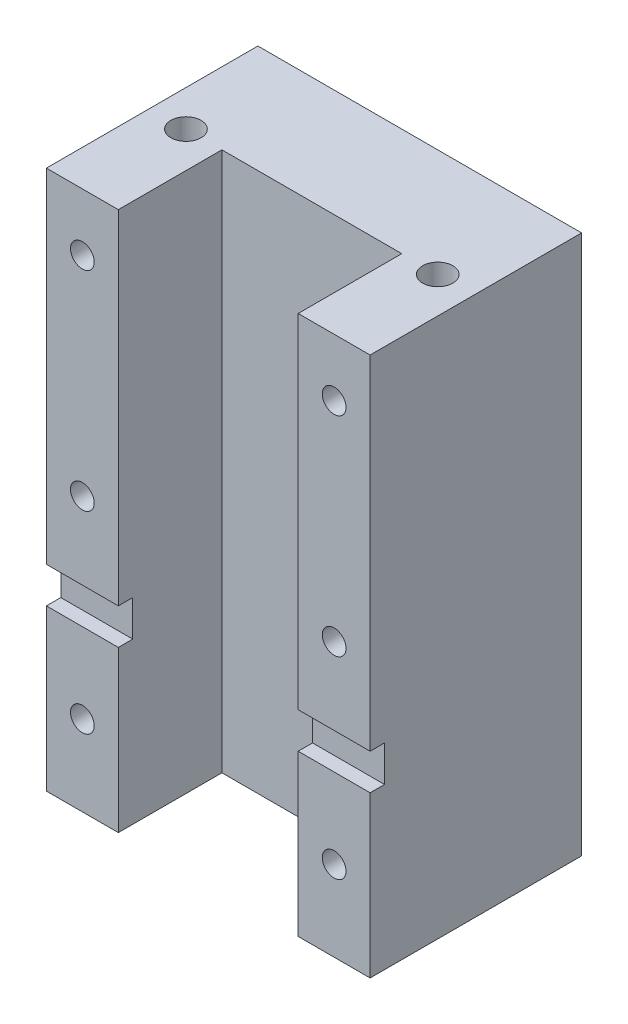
ISO-10303-21;
HEADER;
FILE_DESCRIPTION(('STEP AP214'),'2;1');
FILE_NAME('part.step','',(''),(''),'','','');
FILE_SCHEMA(('AUTOMOTIVE_DESIGN { 1 0 10303 214 1 1 1 1 }'));
ENDSEC;
DATA;
#1=APPLICATION_CONTEXT('core data for automotive mechanical design processes');
#2=APPLICATION_PROTOCOL_DEFINITION('international standard','automotive_design',2000,#1);
#3=PRODUCT_CONTEXT('',#1,'mechanical');
#4=PRODUCT('Part','Part','',(#3));
#5=PRODUCT_RELATED_PRODUCT_CATEGORY('part','',(#4));
#6=PRODUCT_DEFINITION_FORMATION('','',#4);
#7=PRODUCT_DEFINITION_CONTEXT('part definition',#1,'design');
#8=PRODUCT_DEFINITION('design','',#6,#7);
#9=PRODUCT_DEFINITION_SHAPE('','',#8);
#10=(LENGTH_UNIT() NAMED_UNIT(*) SI_UNIT(.MILLI.,.METRE.));
#11=(NAMED_UNIT(*) PLANE_ANGLE_UNIT() SI_UNIT($,.RADIAN.));
#12=(NAMED_UNIT(*) SI_UNIT($,.STERADIAN.) SOLID_ANGLE_UNIT());
#13=UNCERTAINTY_MEASURE_WITH_UNIT(LENGTH_MEASURE(1.E-05),#10,'distance_accuracy_value','');
#14=(GEOMETRIC_REPRESENTATION_CONTEXT(3) GLOBAL_UNCERTAINTY_ASSIGNED_CONTEXT((#13)) GLOBAL_UNIT_ASSIGNED_CONTEXT((#10,
#11,#12)) REPRESENTATION_CONTEXT('',''));
#15=CARTESIAN_POINT('',(0.,0.,0.));
#16=DIRECTION('',(0.,0.,1.));
#17=DIRECTION('',(1.,0.,0.));
#18=AXIS2_PLACEMENT_3D('',#15,#16,#17);
#19=CARTESIAN_POINT('',(45.,1.13686837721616E-13,29.4));
#20=DIRECTION('',(0.,0.,1.));
#21=DIRECTION('',(1.,0.,0.));
#22=AXIS2_PLACEMENT_3D('',#19,#20,#21);
#23=PLANE('',#22);
#24=CARTESIAN_POINT('',(5.,38.,29.4));
#25=DIRECTION('',(0.,0.,1.));
#26=DIRECTION('',(1.,0.,0.));
#27=AXIS2_PLACEMENT_3D('',#24,#25,#26);
#28=CIRCLE('',#27,1.65);
#29=CARTESIAN_POINT('',(6.65,38.,29.4));
#30=VERTEX_POINT('',#29);
#31=EDGE_CURVE('E341',#30,#30,#28,.T.);
#32=ORIENTED_EDGE('',*,*,#31,.F.);
#33=EDGE_LOOP('',(#32));
#34=FACE_BOUND('',#33,.T.);
#35=CARTESIAN_POINT('',(4.99999999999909,67.0000000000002,29.4));
#36=DIRECTION('',(0.,0.,1.));
#37=DIRECTION('',(1.,0.,0.));
#38=AXIS2_PLACEMENT_3D('',#35,#36,#37);
#39=CIRCLE('',#38,1.65);
#40=CARTESIAN_POINT('',(6.64999999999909,67.0000000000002,29.4));
#41=VERTEX_POINT('',#40);
#42=EDGE_CURVE('E323',#41,#41,#39,.T.);
#43=ORIENTED_EDGE('',*,*,#42,.F.);
#44=EDGE_LOOP('',(#43));
#45=FACE_BOUND('',#44,.T.);
#46=DIRECTION('',(1.,0.,0.));
#47=VECTOR('',#46,1.);
#48=CARTESIAN_POINT('',(45.,27.3000003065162,29.4));
#49=LINE('',#48,#47);
#50=CARTESIAN_POINT('',(0.,27.3000003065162,29.3999999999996));
#51=VERTEX_POINT('',#50);
#52=CARTESIAN_POINT('',(10.,27.3000003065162,29.4000000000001));
#53=VERTEX_POINT('',#52);
#54=EDGE_CURVE('E205',#51,#53,#49,.T.);
#55=ORIENTED_EDGE('',*,*,#54,.T.);
#56=DIRECTION('',(0.,-1.,0.));
#57=VECTOR('',#56,1.);
#58=CARTESIAN_POINT('',(10.,249.966611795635,29.4000000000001));
#59=LINE('',#58,#57);
#60=CARTESIAN_POINT('',(10.,75.0000000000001,29.4000000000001));
#61=VERTEX_POINT('',#60);
#62=EDGE_CURVE('E278',#61,#53,#59,.T.);
#63=ORIENTED_EDGE('',*,*,#62,.F.);
#64=DIRECTION('',(-1.,0.,0.));
#65=VECTOR('',#64,1.);
#66=CARTESIAN_POINT('',(0.,75.0000000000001,29.4));
#67=LINE('',#66,#65);
#68=CARTESIAN_POINT('',(0.,75.0000000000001,29.4));
#69=VERTEX_POINT('',#68);
#70=EDGE_CURVE('E170',#61,#69,#67,.T.);
#71=ORIENTED_EDGE('',*,*,#70,.T.);
#72=DIRECTION('',(0.,-1.,0.));
#73=VECTOR('',#72,1.);
#74=CARTESIAN_POINT('',(0.,1.13686837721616E-13,29.4));
#75=LINE('',#74,#73);
#76=EDGE_CURVE('E172',#69,#51,#75,.T.);
#77=ORIENTED_EDGE('',*,*,#76,.T.);
#78=EDGE_LOOP('',(#55,#63,#71,#77));
#79=FACE_BOUND('',#78,.T.);
#80=ADVANCED_FACE('F32',(#34,#45,#79),#23,.T.);
#81=CARTESIAN_POINT('',(40.,38.,29.4));
#82=DIRECTION('',(0.,0.,1.));
#83=DIRECTION('',(1.,0.,0.));
#84=AXIS2_PLACEMENT_3D('',#81,#82,#83);
#85=CIRCLE('',#84,1.65);
#86=CARTESIAN_POINT('',(41.65,38.,29.4));
#87=VERTEX_POINT('',#86);
#88=EDGE_CURVE('E335',#87,#87,#85,.T.);
#89=ORIENTED_EDGE('',*,*,#88,.F.);
#90=EDGE_LOOP('',(#89));
#91=FACE_BOUND('',#90,.T.);
#92=CARTESIAN_POINT('',(39.9999999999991,67.,29.4));
#93=DIRECTION('',(0.,0.,1.));
#94=DIRECTION('',(1.,0.,0.));
#95=AXIS2_PLACEMENT_3D('',#92,#93,#94);
#96=CIRCLE('',#95,1.65);
#97=CARTESIAN_POINT('',(41.6499999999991,67.,29.4));
#98=VERTEX_POINT('',#97);
#99=EDGE_CURVE('E329',#98,#98,#96,.T.);
#100=ORIENTED_EDGE('',*,*,#99,.F.);
#101=EDGE_LOOP('',(#100));
#102=FACE_BOUND('',#101,.T.);
#103=CARTESIAN_POINT('',(45.,75.0000000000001,29.4));
#104=VERTEX_POINT('',#103);
#105=CARTESIAN_POINT('',(35.,75.0000000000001,29.4000000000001));
#106=VERTEX_POINT('',#105);
#107=EDGE_CURVE('E162',#104,#106,#67,.T.);
#108=ORIENTED_EDGE('',*,*,#107,.T.);
#109=DIRECTION('',(0.,-1.,0.));
#110=VECTOR('',#109,1.);
#111=CARTESIAN_POINT('',(35.,249.966611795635,29.4000000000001));
#112=LINE('',#111,#110);
#113=CARTESIAN_POINT('',(35.,27.3000003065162,29.4000000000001));
#114=VERTEX_POINT('',#113);
#115=EDGE_CURVE('E143',#106,#114,#112,.T.);
#116=ORIENTED_EDGE('',*,*,#115,.T.);
#117=CARTESIAN_POINT('',(45.,27.3000003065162,29.3999999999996));
#118=VERTEX_POINT('',#117);
#119=EDGE_CURVE('E204',#114,#118,#49,.T.);
#120=ORIENTED_EDGE('',*,*,#119,.T.);
#121=DIRECTION('',(0.,1.,0.));
#122=VECTOR('',#121,1.);
#123=CARTESIAN_POINT('',(45.,1.13686837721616E-13,29.4));
#124=LINE('',#123,#122);
#125=EDGE_CURVE('E167',#118,#104,#124,.T.);
#126=ORIENTED_EDGE('',*,*,#125,.T.);
#127=EDGE_LOOP('',(#108,#116,#120,#126));
#128=FACE_BOUND('',#127,.T.);
#129=ADVANCED_FACE('F165',(#91,#102,#128),#23,.T.);
#130=CARTESIAN_POINT('',(5.00000000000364,11.1800003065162,29.4));
#131=DIRECTION('',(0.,0.,1.));
#132=DIRECTION('',(1.,0.,0.));
#133=AXIS2_PLACEMENT_3D('',#130,#131,#132);
#134=CIRCLE('',#133,1.65);
#135=CARTESIAN_POINT('',(6.65000000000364,11.1800003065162,29.4));
#136=VERTEX_POINT('',#135);
#137=EDGE_CURVE('E311',#136,#136,#134,.T.);
#138=ORIENTED_EDGE('',*,*,#137,.F.);
#139=EDGE_LOOP('',(#138));
#140=FACE_BOUND('',#139,.T.);
#141=DIRECTION('',(1.,0.,0.));
#142=VECTOR('',#141,1.);
#143=CARTESIAN_POINT('',(0.,1.13686837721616E-13,29.4));
#144=LINE('',#143,#142);
#145=CARTESIAN_POINT('',(0.,1.13686837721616E-13,29.4));
#146=VERTEX_POINT('',#145);
#147=CARTESIAN_POINT('',(10.,1.11022302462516E-13,29.4000000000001));
#148=VERTEX_POINT('',#147);
#149=EDGE_CURVE('E247',#146,#148,#144,.T.);
#150=ORIENTED_EDGE('',*,*,#149,.T.);
#151=CARTESIAN_POINT('',(10.,22.3000003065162,29.4000000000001));
#152=VERTEX_POINT('',#151);
#153=EDGE_CURVE('E292',#152,#148,#59,.T.);
#154=ORIENTED_EDGE('',*,*,#153,.F.);
#155=DIRECTION('',(-1.,0.,0.));
#156=VECTOR('',#155,1.);
#157=CARTESIAN_POINT('',(45.,22.3000003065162,29.4));
#158=LINE('',#157,#156);
#159=CARTESIAN_POINT('',(0.,22.3000003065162,29.4));
#160=VERTEX_POINT('',#159);
#161=EDGE_CURVE('E55',#152,#160,#158,.T.);
#162=ORIENTED_EDGE('',*,*,#161,.T.);
#163=EDGE_CURVE('E169',#160,#146,#75,.T.);
#164=ORIENTED_EDGE('',*,*,#163,.T.);
#165=EDGE_LOOP('',(#150,#154,#162,#164));
#166=FACE_BOUND('',#165,.T.);
#167=ADVANCED_FACE('F514',(#140,#166),#23,.T.);
#168=CARTESIAN_POINT('',(40.,11.1800003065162,29.4));
#169=DIRECTION('',(0.,0.,1.));
#170=DIRECTION('',(1.,0.,0.));
#171=AXIS2_PLACEMENT_3D('',#168,#169,#170);
#172=CIRCLE('',#171,1.65);
#173=CARTESIAN_POINT('',(41.65,11.1800003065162,29.4));
#174=VERTEX_POINT('',#173);
#175=EDGE_CURVE('E317',#174,#174,#172,.T.);
#176=ORIENTED_EDGE('',*,*,#175,.F.);
#177=EDGE_LOOP('',(#176));
#178=FACE_BOUND('',#177,.T.);
#179=CARTESIAN_POINT('',(45.,22.3000003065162,29.3999999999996));
#180=VERTEX_POINT('',#179);
#181=CARTESIAN_POINT('',(35.,22.3000003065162,29.4));
#182=VERTEX_POINT('',#181);
#183=EDGE_CURVE('E201',#180,#182,#158,.T.);
#184=ORIENTED_EDGE('',*,*,#183,.T.);
#185=CARTESIAN_POINT('',(35.,1.11022302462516E-13,29.4000000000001));
#186=VERTEX_POINT('',#185);
#187=EDGE_CURVE('E47',#182,#186,#112,.T.);
#188=ORIENTED_EDGE('',*,*,#187,.T.);
#189=CARTESIAN_POINT('',(45.,1.13686837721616E-13,29.4));
#190=VERTEX_POINT('',#189);
#191=EDGE_CURVE('E190',#186,#190,#144,.T.);
#192=ORIENTED_EDGE('',*,*,#191,.T.);
#193=EDGE_CURVE('E174',#190,#180,#124,.T.);
#194=ORIENTED_EDGE('',*,*,#193,.T.);
#195=EDGE_LOOP('',(#184,#188,#192,#194));
#196=FACE_BOUND('',#195,.T.);
#197=ADVANCED_FACE('F254',(#178,#196),#23,.T.);
#198=CARTESIAN_POINT('',(0.,1.13686837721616E-13,29.4));
#199=DIRECTION('',(0.,1.,0.));
#200=DIRECTION('',(0.,0.,1.));
#201=AXIS2_PLACEMENT_3D('',#198,#199,#200);
#202=PLANE('',#201);
#203=CARTESIAN_POINT('',(39.9999999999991,1.11022302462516E-13,15.));
#204=DIRECTION('',(0.,1.,0.));
#205=DIRECTION('',(0.,0.,1.));
#206=AXIS2_PLACEMENT_3D('',#203,#204,#205);
#207=CIRCLE('',#206,2.09999999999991);
#208=CARTESIAN_POINT('',(39.9999999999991,1.11022302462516E-13,17.0999999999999));
#209=VERTEX_POINT('',#208);
#210=EDGE_CURVE('E302',#209,#209,#207,.T.);
#211=ORIENTED_EDGE('',*,*,#210,.T.);
#212=EDGE_LOOP('',(#211));
#213=FACE_BOUND('',#212,.T.);
#214=CARTESIAN_POINT('',(4.99999999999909,1.11022302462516E-13,15.));
#215=DIRECTION('',(0.,1.,0.));
#216=DIRECTION('',(0.,0.,1.));
#217=AXIS2_PLACEMENT_3D('',#214,#215,#216);
#218=CIRCLE('',#217,2.09999999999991);
#219=CARTESIAN_POINT('',(4.99999999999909,1.11022302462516E-13,17.0999999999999));
#220=VERTEX_POINT('',#219);
#221=EDGE_CURVE('E298',#220,#220,#218,.T.);
#222=ORIENTED_EDGE('',*,*,#221,.T.);
#223=EDGE_LOOP('',(#222));
#224=FACE_BOUND('',#223,.T.);
#225=DIRECTION('',(0.,0.,-1.));
#226=VECTOR('',#225,1.);
#227=CARTESIAN_POINT('',(10.,1.13686837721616E-13,29.4));
#228=LINE('',#227,#226);
#229=CARTESIAN_POINT('',(10.,1.11022302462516E-13,15.));
#230=VERTEX_POINT('',#229);
#231=EDGE_CURVE('E230',#148,#230,#228,.T.);
#232=ORIENTED_EDGE('',*,*,#231,.F.);
#233=ORIENTED_EDGE('',*,*,#149,.F.);
#234=DIRECTION('',(0.,0.,-1.));
#235=VECTOR('',#234,1.);
#236=CARTESIAN_POINT('',(0.,1.13686837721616E-13,29.4));
#237=LINE('',#236,#235);
#238=CARTESIAN_POINT('',(0.,1.13686837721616E-13,0.));
#239=VERTEX_POINT('',#238);
#240=EDGE_CURVE('E179',#146,#239,#237,.T.);
#241=ORIENTED_EDGE('',*,*,#240,.T.);
#242=DIRECTION('',(1.,0.,0.));
#243=VECTOR('',#242,1.);
#244=CARTESIAN_POINT('',(0.,1.13686837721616E-13,0.));
#245=LINE('',#244,#243);
#246=CARTESIAN_POINT('',(45.,1.13686837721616E-13,0.));
#247=VERTEX_POINT('',#246);
#248=EDGE_CURVE('E180',#239,#247,#245,.T.);
#249=ORIENTED_EDGE('',*,*,#248,.T.);
#250=DIRECTION('',(0.,0.,-1.));
#251=VECTOR('',#250,1.);
#252=CARTESIAN_POINT('',(45.,1.13686837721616E-13,29.4));
#253=LINE('',#252,#251);
#254=EDGE_CURVE('E198',#190,#247,#253,.T.);
#255=ORIENTED_EDGE('',*,*,#254,.F.);
#256=ORIENTED_EDGE('',*,*,#191,.F.);
#257=DIRECTION('',(0.,0.,1.));
#258=VECTOR('',#257,1.);
#259=CARTESIAN_POINT('',(35.,1.13686837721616E-13,29.4));
#260=LINE('',#259,#258);
#261=CARTESIAN_POINT('',(35.,1.11022302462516E-13,15.));
#262=VERTEX_POINT('',#261);
#263=EDGE_CURVE('E163',#262,#186,#260,.T.);
#264=ORIENTED_EDGE('',*,*,#263,.F.);
#265=DIRECTION('',(1.,0.,0.));
#266=VECTOR('',#265,1.);
#267=CARTESIAN_POINT('',(0.,1.13686837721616E-13,15.));
#268=LINE('',#267,#266);
#269=EDGE_CURVE('E226',#230,#262,#268,.T.);
#270=ORIENTED_EDGE('',*,*,#269,.F.);
#271=EDGE_LOOP('',(#232,#233,#241,#249,#255,#256,#264,#270));
#272=FACE_BOUND('',#271,.T.);
#273=ADVANCED_FACE('F34',(#213,#224,#272),#202,.F.);
#274=CARTESIAN_POINT('',(0.,75.0000000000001,29.4));
#275=DIRECTION('',(0.,-1.,0.));
#276=DIRECTION('',(0.,0.,-1.));
#277=AXIS2_PLACEMENT_3D('',#274,#275,#276);
#278=PLANE('',#277);
#279=CARTESIAN_POINT('',(39.9999999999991,75.0000000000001,15.));
#280=DIRECTION('',(0.,1.,0.));
#281=DIRECTION('',(0.,0.,1.));
#282=AXIS2_PLACEMENT_3D('',#279,#280,#281);
#283=CIRCLE('',#282,2.09999999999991);
#284=CARTESIAN_POINT('',(39.9999999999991,75.0000000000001,17.0999999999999));
#285=VERTEX_POINT('',#284);
#286=EDGE_CURVE('E305',#285,#285,#283,.T.);
#287=ORIENTED_EDGE('',*,*,#286,.F.);
#288=EDGE_LOOP('',(#287));
#289=FACE_BOUND('',#288,.T.);
#290=CARTESIAN_POINT('',(4.99999999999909,75.0000000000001,15.));
#291=DIRECTION('',(0.,1.,0.));
#292=DIRECTION('',(0.,0.,1.));
#293=AXIS2_PLACEMENT_3D('',#290,#291,#292);
#294=CIRCLE('',#293,2.09999999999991);
#295=CARTESIAN_POINT('',(4.99999999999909,75.0000000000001,17.0999999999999));
#296=VERTEX_POINT('',#295);
#297=EDGE_CURVE('E299',#296,#296,#294,.T.);
#298=ORIENTED_EDGE('',*,*,#297,.F.);
#299=EDGE_LOOP('',(#298));
#300=FACE_BOUND('',#299,.T.);
#301=DIRECTION('',(0.,0.,1.));
#302=VECTOR('',#301,1.);
#303=CARTESIAN_POINT('',(10.,75.0000000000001,29.4));
#304=LINE('',#303,#302);
#305=CARTESIAN_POINT('',(10.,75.0000000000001,15.));
#306=VERTEX_POINT('',#305);
#307=EDGE_CURVE('E279',#306,#61,#304,.T.);
#308=ORIENTED_EDGE('',*,*,#307,.F.);
#309=DIRECTION('',(-1.,0.,0.));
#310=VECTOR('',#309,1.);
#311=CARTESIAN_POINT('',(0.,75.0000000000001,15.));
#312=LINE('',#311,#310);
#313=CARTESIAN_POINT('',(35.,75.0000000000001,15.));
#314=VERTEX_POINT('',#313);
#315=EDGE_CURVE('E11',#314,#306,#312,.T.);
#316=ORIENTED_EDGE('',*,*,#315,.F.);
#317=DIRECTION('',(0.,0.,-1.));
#318=VECTOR('',#317,1.);
#319=CARTESIAN_POINT('',(35.,75.0000000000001,29.4));
#320=LINE('',#319,#318);
#321=EDGE_CURVE('E147',#106,#314,#320,.T.);
#322=ORIENTED_EDGE('',*,*,#321,.F.);
#323=ORIENTED_EDGE('',*,*,#107,.F.);
#324=DIRECTION('',(0.,0.,-1.));
#325=VECTOR('',#324,1.);
#326=CARTESIAN_POINT('',(45.,75.0000000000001,29.4));
#327=LINE('',#326,#325);
#328=CARTESIAN_POINT('',(45.,75.0000000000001,0.));
#329=VERTEX_POINT('',#328);
#330=EDGE_CURVE('E196',#104,#329,#327,.T.);
#331=ORIENTED_EDGE('',*,*,#330,.T.);
#332=DIRECTION('',(-1.,0.,0.));
#333=VECTOR('',#332,1.);
#334=CARTESIAN_POINT('',(0.,75.0000000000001,0.));
#335=LINE('',#334,#333);
#336=CARTESIAN_POINT('',(0.,75.0000000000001,0.));
#337=VERTEX_POINT('',#336);
#338=EDGE_CURVE('E186',#329,#337,#335,.T.);
#339=ORIENTED_EDGE('',*,*,#338,.T.);
#340=DIRECTION('',(0.,0.,-1.));
#341=VECTOR('',#340,1.);
#342=CARTESIAN_POINT('',(0.,75.0000000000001,29.4));
#343=LINE('',#342,#341);
#344=EDGE_CURVE('E193',#69,#337,#343,.T.);
#345=ORIENTED_EDGE('',*,*,#344,.F.);
#346=ORIENTED_EDGE('',*,*,#70,.F.);
#347=EDGE_LOOP('',(#308,#316,#322,#323,#331,#339,#345,#346));
#348=FACE_BOUND('',#347,.T.);
#349=ADVANCED_FACE('F160',(#289,#300,#348),#278,.F.);
#350=CARTESIAN_POINT('',(160.34161217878,22.3000003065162,27.3999999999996));
#351=DIRECTION('',(0.,0.,1.));
#352=DIRECTION('',(1.,0.,0.));
#353=AXIS2_PLACEMENT_3D('',#350,#351,#352);
#354=PLANE('',#353);
#355=DIRECTION('',(-1.,0.,0.));
#356=VECTOR('',#355,1.);
#357=CARTESIAN_POINT('',(160.34161217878,22.3000003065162,27.3999999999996));
#358=LINE('',#357,#356);
#359=CARTESIAN_POINT('',(10.,22.3000003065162,27.3999999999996));
#360=VERTEX_POINT('',#359);
#361=CARTESIAN_POINT('',(0.,22.3000003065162,27.3999999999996));
#362=VERTEX_POINT('',#361);
#363=EDGE_CURVE('E216',#360,#362,#358,.T.);
#364=ORIENTED_EDGE('',*,*,#363,.F.);
#365=DIRECTION('',(0.,1.,0.));
#366=VECTOR('',#365,1.);
#367=CARTESIAN_POINT('',(10.,22.3000003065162,27.3999999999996));
#368=LINE('',#367,#366);
#369=CARTESIAN_POINT('',(10.,27.3000003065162,27.3999999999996));
#370=VERTEX_POINT('',#369);
#371=EDGE_CURVE('E221',#360,#370,#368,.T.);
#372=ORIENTED_EDGE('',*,*,#371,.T.);
#373=DIRECTION('',(-1.,0.,0.));
#374=VECTOR('',#373,1.);
#375=CARTESIAN_POINT('',(160.34161217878,27.3000003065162,27.3999999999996));
#376=LINE('',#375,#374);
#377=CARTESIAN_POINT('',(0.,27.3000003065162,27.3999999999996));
#378=VERTEX_POINT('',#377);
#379=EDGE_CURVE('E229',#370,#378,#376,.T.);
#380=ORIENTED_EDGE('',*,*,#379,.T.);
#381=DIRECTION('',(0.,-1.,0.));
#382=VECTOR('',#381,1.);
#383=CARTESIAN_POINT('',(0.,1.13686837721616E-13,27.3999999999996));
#384=LINE('',#383,#382);
#385=EDGE_CURVE('E208',#378,#362,#384,.T.);
#386=ORIENTED_EDGE('',*,*,#385,.T.);
#387=EDGE_LOOP('',(#364,#372,#380,#386));
#388=FACE_BOUND('',#387,.T.);
#389=ADVANCED_FACE('F220',(#388),#354,.T.);
#390=CARTESIAN_POINT('',(45.,27.3000003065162,27.3999999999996));
#391=VERTEX_POINT('',#390);
#392=CARTESIAN_POINT('',(35.,27.3000003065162,27.3999999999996));
#393=VERTEX_POINT('',#392);
#394=EDGE_CURVE('E234',#391,#393,#376,.T.);
#395=ORIENTED_EDGE('',*,*,#394,.T.);
#396=DIRECTION('',(0.,-1.,0.));
#397=VECTOR('',#396,1.);
#398=CARTESIAN_POINT('',(35.,22.3000003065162,27.3999999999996));
#399=LINE('',#398,#397);
#400=CARTESIAN_POINT('',(35.,22.3000003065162,27.3999999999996));
#401=VERTEX_POINT('',#400);
#402=EDGE_CURVE('E289',#393,#401,#399,.T.);
#403=ORIENTED_EDGE('',*,*,#402,.T.);
#404=CARTESIAN_POINT('',(45.,22.3000003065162,27.3999999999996));
#405=VERTEX_POINT('',#404);
#406=EDGE_CURVE('E225',#405,#401,#358,.T.);
#407=ORIENTED_EDGE('',*,*,#406,.F.);
#408=DIRECTION('',(0.,1.,0.));
#409=VECTOR('',#408,1.);
#410=CARTESIAN_POINT('',(45.,1.13686837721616E-13,27.3999999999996));
#411=LINE('',#410,#409);
#412=EDGE_CURVE('E184',#405,#391,#411,.T.);
#413=ORIENTED_EDGE('',*,*,#412,.T.);
#414=EDGE_LOOP('',(#395,#403,#407,#413));
#415=FACE_BOUND('',#414,.T.);
#416=ADVANCED_FACE('F414',(#415),#354,.T.);
#417=CARTESIAN_POINT('',(160.34161217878,27.3000003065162,29.3999999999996));
#418=DIRECTION('',(0.,-1.,0.));
#419=DIRECTION('',(0.,0.,-1.));
#420=AXIS2_PLACEMENT_3D('',#417,#418,#419);
#421=PLANE('',#420);
#422=ORIENTED_EDGE('',*,*,#379,.F.);
#423=DIRECTION('',(0.,0.,1.));
#424=VECTOR('',#423,1.);
#425=CARTESIAN_POINT('',(10.,27.3000003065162,29.3999999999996));
#426=LINE('',#425,#424);
#427=EDGE_CURVE('E281',#370,#53,#426,.T.);
#428=ORIENTED_EDGE('',*,*,#427,.T.);
#429=ORIENTED_EDGE('',*,*,#54,.F.);
#430=DIRECTION('',(0.,0.,-1.));
#431=VECTOR('',#430,1.);
#432=CARTESIAN_POINT('',(0.,27.3000003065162,29.4));
#433=LINE('',#432,#431);
#434=EDGE_CURVE('E241',#51,#378,#433,.T.);
#435=ORIENTED_EDGE('',*,*,#434,.T.);
#436=EDGE_LOOP('',(#422,#428,#429,#435));
#437=FACE_BOUND('',#436,.T.);
#438=ADVANCED_FACE('F415',(#437),#421,.T.);
#439=ORIENTED_EDGE('',*,*,#119,.F.);
#440=DIRECTION('',(0.,0.,-1.));
#441=VECTOR('',#440,1.);
#442=CARTESIAN_POINT('',(35.,27.3000003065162,29.3999999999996));
#443=LINE('',#442,#441);
#444=EDGE_CURVE('E150',#114,#393,#443,.T.);
#445=ORIENTED_EDGE('',*,*,#444,.T.);
#446=ORIENTED_EDGE('',*,*,#394,.F.);
#447=DIRECTION('',(0.,0.,1.));
#448=VECTOR('',#447,1.);
#449=CARTESIAN_POINT('',(45.,27.3000003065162,29.4));
#450=LINE('',#449,#448);
#451=EDGE_CURVE('E244',#391,#118,#450,.T.);
#452=ORIENTED_EDGE('',*,*,#451,.T.);
#453=EDGE_LOOP('',(#439,#445,#446,#452));
#454=FACE_BOUND('',#453,.T.);
#455=ADVANCED_FACE('F411',(#454),#421,.T.);
#456=CARTESIAN_POINT('',(160.34161217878,22.3000003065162,29.3999999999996));
#457=DIRECTION('',(0.,1.,0.));
#458=DIRECTION('',(0.,0.,1.));
#459=AXIS2_PLACEMENT_3D('',#456,#457,#458);
#460=PLANE('',#459);
#461=ORIENTED_EDGE('',*,*,#161,.F.);
#462=DIRECTION('',(0.,0.,-1.));
#463=VECTOR('',#462,1.);
#464=CARTESIAN_POINT('',(10.,22.3000003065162,29.3999999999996));
#465=LINE('',#464,#463);
#466=EDGE_CURVE('E40',#152,#360,#465,.T.);
#467=ORIENTED_EDGE('',*,*,#466,.T.);
#468=ORIENTED_EDGE('',*,*,#363,.T.);
#469=DIRECTION('',(0.,0.,1.));
#470=VECTOR('',#469,1.);
#471=CARTESIAN_POINT('',(0.,22.3000003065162,29.4));
#472=LINE('',#471,#470);
#473=EDGE_CURVE('E237',#362,#160,#472,.T.);
#474=ORIENTED_EDGE('',*,*,#473,.T.);
#475=EDGE_LOOP('',(#461,#467,#468,#474));
#476=FACE_BOUND('',#475,.T.);
#477=ADVANCED_FACE('F215',(#476),#460,.T.);
#478=ORIENTED_EDGE('',*,*,#406,.T.);
#479=DIRECTION('',(0.,0.,1.));
#480=VECTOR('',#479,1.);
#481=CARTESIAN_POINT('',(35.,22.3000003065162,29.3999999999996));
#482=LINE('',#481,#480);
#483=EDGE_CURVE('E211',#401,#182,#482,.T.);
#484=ORIENTED_EDGE('',*,*,#483,.T.);
#485=ORIENTED_EDGE('',*,*,#183,.F.);
#486=DIRECTION('',(0.,0.,-1.));
#487=VECTOR('',#486,1.);
#488=CARTESIAN_POINT('',(45.,22.3000003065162,29.4));
#489=LINE('',#488,#487);
#490=EDGE_CURVE('E239',#180,#405,#489,.T.);
#491=ORIENTED_EDGE('',*,*,#490,.T.);
#492=EDGE_LOOP('',(#478,#484,#485,#491));
#493=FACE_BOUND('',#492,.T.);
#494=ADVANCED_FACE('F410',(#493),#460,.T.);
#495=CARTESIAN_POINT('',(45.,1.13686837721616E-13,29.4));
#496=DIRECTION('',(-1.,0.,0.));
#497=DIRECTION('',(0.,0.,1.));
#498=AXIS2_PLACEMENT_3D('',#495,#496,#497);
#499=PLANE('',#498);
#500=ORIENTED_EDGE('',*,*,#451,.F.);
#501=ORIENTED_EDGE('',*,*,#412,.F.);
#502=ORIENTED_EDGE('',*,*,#490,.F.);
#503=ORIENTED_EDGE('',*,*,#193,.F.);
#504=ORIENTED_EDGE('',*,*,#254,.T.);
#505=DIRECTION('',(0.,1.,0.));
#506=VECTOR('',#505,1.);
#507=CARTESIAN_POINT('',(45.,1.13686837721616E-13,0.));
#508=LINE('',#507,#506);
#509=EDGE_CURVE('E183',#247,#329,#508,.T.);
#510=ORIENTED_EDGE('',*,*,#509,.T.);
#511=ORIENTED_EDGE('',*,*,#330,.F.);
#512=ORIENTED_EDGE('',*,*,#125,.F.);
#513=EDGE_LOOP('',(#500,#501,#502,#503,#504,#510,#511,#512));
#514=FACE_BOUND('',#513,.T.);
#515=ADVANCED_FACE('F261',(#514),#499,.F.);
#516=CARTESIAN_POINT('',(0.,1.13686837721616E-13,29.4));
#517=DIRECTION('',(1.,0.,0.));
#518=DIRECTION('',(0.,0.,-1.));
#519=AXIS2_PLACEMENT_3D('',#516,#517,#518);
#520=PLANE('',#519);
#521=ORIENTED_EDGE('',*,*,#434,.F.);
#522=ORIENTED_EDGE('',*,*,#76,.F.);
#523=ORIENTED_EDGE('',*,*,#344,.T.);
#524=DIRECTION('',(0.,-1.,0.));
#525=VECTOR('',#524,1.);
#526=CARTESIAN_POINT('',(0.,1.13686837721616E-13,0.));
#527=LINE('',#526,#525);
#528=EDGE_CURVE('E188',#337,#239,#527,.T.);
#529=ORIENTED_EDGE('',*,*,#528,.T.);
#530=ORIENTED_EDGE('',*,*,#240,.F.);
#531=ORIENTED_EDGE('',*,*,#163,.F.);
#532=ORIENTED_EDGE('',*,*,#473,.F.);
#533=ORIENTED_EDGE('',*,*,#385,.F.);
#534=EDGE_LOOP('',(#521,#522,#523,#529,#530,#531,#532,#533));
#535=FACE_BOUND('',#534,.T.);
#536=ADVANCED_FACE('F275',(#535),#520,.F.);
#537=CARTESIAN_POINT('',(45.,1.13686837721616E-13,0.));
#538=DIRECTION('',(0.,0.,1.));
#539=DIRECTION('',(1.,0.,0.));
#540=AXIS2_PLACEMENT_3D('',#537,#538,#539);
#541=PLANE('',#540);
#542=ORIENTED_EDGE('',*,*,#248,.F.);
#543=ORIENTED_EDGE('',*,*,#528,.F.);
#544=ORIENTED_EDGE('',*,*,#338,.F.);
#545=ORIENTED_EDGE('',*,*,#509,.F.);
#546=EDGE_LOOP('',(#542,#543,#544,#545));
#547=FACE_BOUND('',#546,.T.);
#548=ADVANCED_FACE('F268',(#547),#541,.F.);
#549=CARTESIAN_POINT('',(10.,249.966611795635,15.));
#550=DIRECTION('',(0.,0.,1.));
#551=DIRECTION('',(1.,0.,0.));
#552=AXIS2_PLACEMENT_3D('',#549,#550,#551);
#553=PLANE('',#552);
#554=DIRECTION('',(0.,-1.,0.));
#555=VECTOR('',#554,1.);
#556=CARTESIAN_POINT('',(10.,249.966611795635,15.));
#557=LINE('',#556,#555);
#558=EDGE_CURVE('E294',#306,#230,#557,.T.);
#559=ORIENTED_EDGE('',*,*,#558,.T.);
#560=ORIENTED_EDGE('',*,*,#269,.T.);
#561=DIRECTION('',(0.,-1.,0.));
#562=VECTOR('',#561,1.);
#563=CARTESIAN_POINT('',(35.,249.966611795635,15.));
#564=LINE('',#563,#562);
#565=EDGE_CURVE('E154',#314,#262,#564,.T.);
#566=ORIENTED_EDGE('',*,*,#565,.F.);
#567=ORIENTED_EDGE('',*,*,#315,.T.);
#568=EDGE_LOOP('',(#559,#560,#566,#567));
#569=FACE_BOUND('',#568,.T.);
#570=ADVANCED_FACE('F402',(#569),#553,.T.);
#571=CARTESIAN_POINT('',(10.,249.966611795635,29.4000000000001));
#572=DIRECTION('',(1.,0.,0.));
#573=DIRECTION('',(0.,0.,-1.));
#574=AXIS2_PLACEMENT_3D('',#571,#572,#573);
#575=PLANE('',#574);
#576=ORIENTED_EDGE('',*,*,#153,.T.);
#577=ORIENTED_EDGE('',*,*,#231,.T.);
#578=ORIENTED_EDGE('',*,*,#558,.F.);
#579=ORIENTED_EDGE('',*,*,#307,.T.);
#580=ORIENTED_EDGE('',*,*,#62,.T.);
#581=ORIENTED_EDGE('',*,*,#427,.F.);
#582=ORIENTED_EDGE('',*,*,#371,.F.);
#583=ORIENTED_EDGE('',*,*,#466,.F.);
#584=EDGE_LOOP('',(#576,#577,#578,#579,#580,#581,#582,#583));
#585=FACE_BOUND('',#584,.T.);
#586=ADVANCED_FACE('F401',(#585),#575,.T.);
#587=CARTESIAN_POINT('',(35.,249.966611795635,29.4000000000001));
#588=DIRECTION('',(-1.,0.,0.));
#589=DIRECTION('',(0.,0.,1.));
#590=AXIS2_PLACEMENT_3D('',#587,#588,#589);
#591=PLANE('',#590);
#592=ORIENTED_EDGE('',*,*,#565,.T.);
#593=ORIENTED_EDGE('',*,*,#263,.T.);
#594=ORIENTED_EDGE('',*,*,#187,.F.);
#595=ORIENTED_EDGE('',*,*,#483,.F.);
#596=ORIENTED_EDGE('',*,*,#402,.F.);
#597=ORIENTED_EDGE('',*,*,#444,.F.);
#598=ORIENTED_EDGE('',*,*,#115,.F.);
#599=ORIENTED_EDGE('',*,*,#321,.T.);
#600=EDGE_LOOP('',(#592,#593,#594,#595,#596,#597,#598,#599));
#601=FACE_BOUND('',#600,.T.);
#602=ADVANCED_FACE('F146',(#601),#591,.T.);
#603=CARTESIAN_POINT('',(4.99999999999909,1.11022302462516E-13,15.));
#604=DIRECTION('',(0.,1.,0.));
#605=DIRECTION('',(0.,0.,1.));
#606=AXIS2_PLACEMENT_3D('',#603,#604,#605);
#607=CYLINDRICAL_SURFACE('',#606,2.09999999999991);
#608=ORIENTED_EDGE('',*,*,#221,.F.);
#609=EDGE_LOOP('',(#608));
#610=FACE_BOUND('',#609,.T.);
#611=ORIENTED_EDGE('',*,*,#297,.T.);
#612=EDGE_LOOP('',(#611));
#613=FACE_BOUND('',#612,.T.);
#614=ADVANCED_FACE('F394',(#610,#613),#607,.F.);
#615=CARTESIAN_POINT('',(39.9999999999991,1.11022302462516E-13,15.));
#616=DIRECTION('',(0.,1.,0.));
#617=DIRECTION('',(0.,0.,1.));
#618=AXIS2_PLACEMENT_3D('',#615,#616,#617);
#619=CYLINDRICAL_SURFACE('',#618,2.09999999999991);
#620=ORIENTED_EDGE('',*,*,#210,.F.);
#621=EDGE_LOOP('',(#620));
#622=FACE_BOUND('',#621,.T.);
#623=ORIENTED_EDGE('',*,*,#286,.T.);
#624=EDGE_LOOP('',(#623));
#625=FACE_BOUND('',#624,.T.);
#626=ADVANCED_FACE('F390',(#622,#625),#619,.F.);
#627=CARTESIAN_POINT('',(5.00000000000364,11.1800003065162,17.4));
#628=DIRECTION('',(0.,0.,1.));
#629=DIRECTION('',(1.,0.,0.));
#630=AXIS2_PLACEMENT_3D('',#627,#628,#629);
#631=CYLINDRICAL_SURFACE('',#630,1.65);
#632=CARTESIAN_POINT('',(5.00000000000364,11.1800003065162,17.4));
#633=DIRECTION('',(0.,0.,1.));
#634=DIRECTION('',(1.,0.,0.));
#635=AXIS2_PLACEMENT_3D('',#632,#633,#634);
#636=CIRCLE('',#635,1.65);
#637=CARTESIAN_POINT('',(6.65000000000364,11.1800003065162,17.4));
#638=VERTEX_POINT('',#637);
#639=EDGE_CURVE('E308',#638,#638,#636,.T.);
#640=ORIENTED_EDGE('',*,*,#639,.F.);
#641=EDGE_LOOP('',(#640));
#642=FACE_BOUND('',#641,.T.);
#643=ORIENTED_EDGE('',*,*,#137,.T.);
#644=EDGE_LOOP('',(#643));
#645=FACE_BOUND('',#644,.T.);
#646=ADVANCED_FACE('F386',(#642,#645),#631,.F.);
#647=CARTESIAN_POINT('',(5.00000000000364,11.1800003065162,17.4));
#648=DIRECTION('',(0.,0.,1.));
#649=DIRECTION('',(1.,0.,0.));
#650=AXIS2_PLACEMENT_3D('',#647,#648,#649);
#651=PLANE('',#650);
#652=ORIENTED_EDGE('',*,*,#639,.T.);
#653=EDGE_LOOP('',(#652));
#654=FACE_BOUND('',#653,.T.);
#655=ADVANCED_FACE('F382',(#654),#651,.T.);
#656=CARTESIAN_POINT('',(40.,11.1800003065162,17.4));
#657=DIRECTION('',(0.,0.,1.));
#658=DIRECTION('',(1.,0.,0.));
#659=AXIS2_PLACEMENT_3D('',#656,#657,#658);
#660=CYLINDRICAL_SURFACE('',#659,1.65);
#661=CARTESIAN_POINT('',(40.,11.1800003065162,17.4));
#662=DIRECTION('',(0.,0.,1.));
#663=DIRECTION('',(1.,0.,0.));
#664=AXIS2_PLACEMENT_3D('',#661,#662,#663);
#665=CIRCLE('',#664,1.65);
#666=CARTESIAN_POINT('',(41.65,11.1800003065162,17.4));
#667=VERTEX_POINT('',#666);
#668=EDGE_CURVE('E314',#667,#667,#665,.T.);
#669=ORIENTED_EDGE('',*,*,#668,.F.);
#670=EDGE_LOOP('',(#669));
#671=FACE_BOUND('',#670,.T.);
#672=ORIENTED_EDGE('',*,*,#175,.T.);
#673=EDGE_LOOP('',(#672));
#674=FACE_BOUND('',#673,.T.);
#675=ADVANCED_FACE('F374',(#671,#674),#660,.F.);
#676=CARTESIAN_POINT('',(40.,11.1800003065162,17.4));
#677=DIRECTION('',(0.,0.,1.));
#678=DIRECTION('',(1.,0.,0.));
#679=AXIS2_PLACEMENT_3D('',#676,#677,#678);
#680=PLANE('',#679);
#681=ORIENTED_EDGE('',*,*,#668,.T.);
#682=EDGE_LOOP('',(#681));
#683=FACE_BOUND('',#682,.T.);
#684=ADVANCED_FACE('F364',(#683),#680,.T.);
#685=CARTESIAN_POINT('',(4.99999999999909,67.0000000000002,17.4));
#686=DIRECTION('',(0.,0.,1.));
#687=DIRECTION('',(1.,0.,0.));
#688=AXIS2_PLACEMENT_3D('',#685,#686,#687);
#689=CYLINDRICAL_SURFACE('',#688,1.65);
#690=CARTESIAN_POINT('',(4.99999999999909,67.0000000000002,17.4));
#691=DIRECTION('',(0.,0.,1.));
#692=DIRECTION('',(1.,0.,0.));
#693=AXIS2_PLACEMENT_3D('',#690,#691,#692);
#694=CIRCLE('',#693,1.65);
#695=CARTESIAN_POINT('',(6.64999999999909,67.0000000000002,17.4));
#696=VERTEX_POINT('',#695);
#697=EDGE_CURVE('E320',#696,#696,#694,.T.);
#698=ORIENTED_EDGE('',*,*,#697,.F.);
#699=EDGE_LOOP('',(#698));
#700=FACE_BOUND('',#699,.T.);
#701=ORIENTED_EDGE('',*,*,#42,.T.);
#702=EDGE_LOOP('',(#701));
#703=FACE_BOUND('',#702,.T.);
#704=ADVANCED_FACE('F361',(#700,#703),#689,.F.);
#705=CARTESIAN_POINT('',(4.99999999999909,67.0000000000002,17.4));
#706=DIRECTION('',(0.,0.,1.));
#707=DIRECTION('',(1.,0.,0.));
#708=AXIS2_PLACEMENT_3D('',#705,#706,#707);
#709=PLANE('',#708);
#710=ORIENTED_EDGE('',*,*,#697,.T.);
#711=EDGE_LOOP('',(#710));
#712=FACE_BOUND('',#711,.T.);
#713=ADVANCED_FACE('F363',(#712),#709,.T.);
#714=CARTESIAN_POINT('',(39.9999999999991,67.,17.4));
#715=DIRECTION('',(0.,0.,1.));
#716=DIRECTION('',(1.,0.,0.));
#717=AXIS2_PLACEMENT_3D('',#714,#715,#716);
#718=CYLINDRICAL_SURFACE('',#717,1.65);
#719=CARTESIAN_POINT('',(39.9999999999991,67.,17.4));
#720=DIRECTION('',(0.,0.,1.));
#721=DIRECTION('',(1.,0.,0.));
#722=AXIS2_PLACEMENT_3D('',#719,#720,#721);
#723=CIRCLE('',#722,1.65);
#724=CARTESIAN_POINT('',(41.6499999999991,67.,17.4));
#725=VERTEX_POINT('',#724);
#726=EDGE_CURVE('E326',#725,#725,#723,.T.);
#727=ORIENTED_EDGE('',*,*,#726,.F.);
#728=EDGE_LOOP('',(#727));
#729=FACE_BOUND('',#728,.T.);
#730=ORIENTED_EDGE('',*,*,#99,.T.);
#731=EDGE_LOOP('',(#730));
#732=FACE_BOUND('',#731,.T.);
#733=ADVANCED_FACE('F371',(#729,#732),#718,.F.);
#734=CARTESIAN_POINT('',(39.9999999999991,67.,17.4));
#735=DIRECTION('',(0.,0.,1.));
#736=DIRECTION('',(1.,0.,0.));
#737=AXIS2_PLACEMENT_3D('',#734,#735,#736);
#738=PLANE('',#737);
#739=ORIENTED_EDGE('',*,*,#726,.T.);
#740=EDGE_LOOP('',(#739));
#741=FACE_BOUND('',#740,.T.);
#742=ADVANCED_FACE('F570',(#741),#738,.T.);
#743=CARTESIAN_POINT('',(40.,38.,17.4));
#744=DIRECTION('',(0.,0.,1.));
#745=DIRECTION('',(1.,0.,0.));
#746=AXIS2_PLACEMENT_3D('',#743,#744,#745);
#747=CYLINDRICAL_SURFACE('',#746,1.65);
#748=CARTESIAN_POINT('',(40.,38.,17.4));
#749=DIRECTION('',(0.,0.,1.));
#750=DIRECTION('',(1.,0.,0.));
#751=AXIS2_PLACEMENT_3D('',#748,#749,#750);
#752=CIRCLE('',#751,1.65);
#753=CARTESIAN_POINT('',(41.65,38.,17.4));
#754=VERTEX_POINT('',#753);
#755=EDGE_CURVE('E332',#754,#754,#752,.T.);
#756=ORIENTED_EDGE('',*,*,#755,.F.);
#757=EDGE_LOOP('',(#756));
#758=FACE_BOUND('',#757,.T.);
#759=ORIENTED_EDGE('',*,*,#88,.T.);
#760=EDGE_LOOP('',(#759));
#761=FACE_BOUND('',#760,.T.);
#762=ADVANCED_FACE('F579',(#758,#761),#747,.F.);
#763=CARTESIAN_POINT('',(40.,38.,17.4));
#764=DIRECTION('',(0.,0.,1.));
#765=DIRECTION('',(1.,0.,0.));
#766=AXIS2_PLACEMENT_3D('',#763,#764,#765);
#767=PLANE('',#766);
#768=ORIENTED_EDGE('',*,*,#755,.T.);
#769=EDGE_LOOP('',(#768));
#770=FACE_BOUND('',#769,.T.);
#771=ADVANCED_FACE('F352',(#770),#767,.T.);
#772=CARTESIAN_POINT('',(5.,38.,17.4));
#773=DIRECTION('',(0.,0.,1.));
#774=DIRECTION('',(1.,0.,0.));
#775=AXIS2_PLACEMENT_3D('',#772,#773,#774);
#776=CYLINDRICAL_SURFACE('',#775,1.65);
#777=CARTESIAN_POINT('',(5.,38.,17.4));
#778=DIRECTION('',(0.,0.,1.));
#779=DIRECTION('',(1.,0.,0.));
#780=AXIS2_PLACEMENT_3D('',#777,#778,#779);
#781=CIRCLE('',#780,1.65);
#782=CARTESIAN_POINT('',(6.65,38.,17.4));
#783=VERTEX_POINT('',#782);
#784=EDGE_CURVE('E338',#783,#783,#781,.T.);
#785=ORIENTED_EDGE('',*,*,#784,.F.);
#786=EDGE_LOOP('',(#785));
#787=FACE_BOUND('',#786,.T.);
#788=ORIENTED_EDGE('',*,*,#31,.T.);
#789=EDGE_LOOP('',(#788));
#790=FACE_BOUND('',#789,.T.);
#791=ADVANCED_FACE('F349',(#787,#790),#776,.F.);
#792=CARTESIAN_POINT('',(5.,38.,17.4));
#793=DIRECTION('',(0.,0.,1.));
#794=DIRECTION('',(1.,0.,0.));
#795=AXIS2_PLACEMENT_3D('',#792,#793,#794);
#796=PLANE('',#795);
#797=ORIENTED_EDGE('',*,*,#784,.T.);
#798=EDGE_LOOP('',(#797));
#799=FACE_BOUND('',#798,.T.);
#800=ADVANCED_FACE('F347',(#799),#796,.T.);
#801=CLOSED_SHELL('',(#80,#129,#167,#197,#273,#349,#389,#416,#438,#455,#477,#494,#515,#536,#548,
#570,#586,#602,#614,#626,#646,#655,#675,#684,#704,#713,#733,#742,#762,#771,#791,#800));
#802=MANIFOLD_SOLID_BREP('B2',#801);
#803=ADVANCED_BREP_SHAPE_REPRESENTATION('',(#18,#802),#14);
#804=SHAPE_DEFINITION_REPRESENTATION(#9,#803);
ENDSEC;
END-ISO-10303-21;
